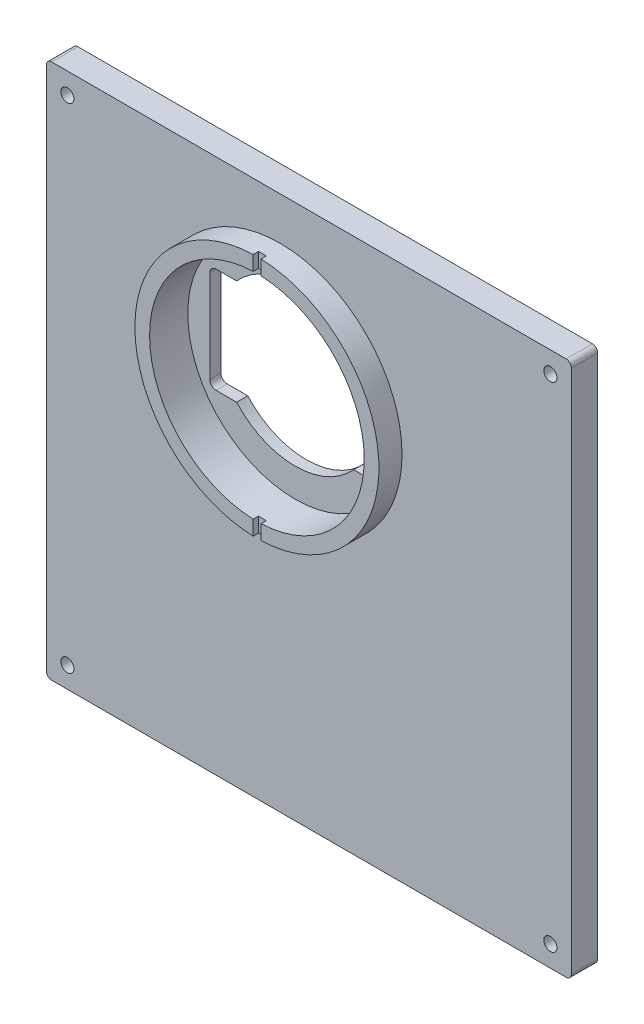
from build123d import *

# Parameters (mm, degrees)
BASE_EXTRUDE_DEPTH  = 6.35
BOSS_OD_R           = 29.5148
BOSS_EXTRUDE3_DEPTH = 5.588
SKETCH5_R           = 25.9588
CUT_EXTRUDE1_DEPTH  = 9.2456
SKETCH6_R           = 19.0119
CUT_EXTRUDE2_DEPTH  = 115.424169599
CUT_EXTRUDE3_DEPTH  = 115.424169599
SKETCH10_W          = 1.905
SKETCH10_H          = 69.451507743
CUT_EXTRUDE5_DEPTH  = 1.27
SKETCH15_R          = 1.5875
CUT_EXTRUDE7_DEPTH  = 115.226669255
SKETCH17_R          = 1.5875
CUT_EXTRUDE8_DEPTH  = 115.226669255


with BuildPart() as part:
    # Sketch1 → Base-Extrude (new body)
    with BuildSketch(Plane.XY):
        with BuildLine():
            Line((-56.515, 38.608), (-56.515, -88.392))
            ThreePointArc((-56.515, -88.392), (-56.143025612, -89.290025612), (-55.245, -89.662))
            Line((-55.245, -89.662), (69.215, -89.662))
            ThreePointArc((69.215, -89.662), (70.113025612, -89.290025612), (70.485, -88.392))
            Line((70.485, -88.392), (70.485, 38.608))
            ThreePointArc((70.485, 38.608), (70.113025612, 39.506025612), (69.215, 39.878))
            Line((69.215, 39.878), (-55.245, 39.878))
            ThreePointArc((-55.245, 39.878), (-56.143025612, 39.506025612), (-56.515, 38.608))
        make_face()
    extrude(amount=BASE_EXTRUDE_DEPTH)

    # BOSS OD → Boss-Extrude3 (add)
    with BuildSketch(Plane.XY.offset(6.35)):
        with Locations(Location((0, 0, 0), (0, 0, 268.273962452))):
            Circle(BOSS_OD_R)
    extrude(amount=BOSS_EXTRUDE3_DEPTH)

    # Sketch5 → Cut-Extrude1 (cut)
    with BuildSketch(Plane.XY.offset(11.938)):
        Circle(SKETCH5_R)
    extrude(amount=-CUT_EXTRUDE1_DEPTH, mode=Mode.SUBTRACT)

    # Sketch6 → Cut-Extrude2 (cut, through all)
    with BuildSketch(Plane.XY.offset(2.6924)):
        Circle(SKETCH6_R)
    extrude(amount=-CUT_EXTRUDE2_DEPTH, mode=Mode.SUBTRACT)

    # Sketch9 → Cut-Extrude3 (cut, through all)
    with BuildSketch(Plane.XY.offset(2.6924)):
        with BuildLine():
            Line((-19.1262, -12.7), (19.1008, -12.7))
            ThreePointArc((19.1008, -12.7), (20.178430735, -12.253630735), (20.6248, -11.176))
            Line((20.6248, -11.176), (20.6248, 11.176))
            ThreePointArc((20.6248, 11.176), (20.178430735, 12.253630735), (19.1008, 12.7))
            Line((19.1008, 12.7), (-19.1262, 12.7))
            ThreePointArc((-19.1262, 12.7), (-20.203830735, 12.253630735), (-20.6502, 11.176))
            Line((-20.6502, 11.176), (-20.6502, -11.176))
            ThreePointArc((-20.6502, -11.176), (-20.203830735, -12.253630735), (-19.1262, -12.7))
        make_face()
    extrude(amount=-CUT_EXTRUDE3_DEPTH, mode=Mode.SUBTRACT)

    # Sketch10 → Cut-Extrude5 (cut)
    with BuildSketch(Plane.XY.offset(11.938)):
        with Locations((0.0635, 0.611504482)):
            Rectangle(SKETCH10_W, SKETCH10_H)
    extrude(amount=-CUT_EXTRUDE5_DEPTH, mode=Mode.SUBTRACT)

    # Sketch15 → Cut-Extrude7 (cut, through all)
    with BuildSketch(Plane.XY.offset(6.35)):
        with Locations((65.405, -84.582)):
            Circle(SKETCH15_R)
    extrude(amount=-CUT_EXTRUDE7_DEPTH, mode=Mode.SUBTRACT)

    # Sketch17 → Cut-Extrude8 (cut, through all)
    with BuildSketch(Plane.XY.offset(6.35)):
        with Locations((-51.435, -84.582)):
            Circle(SKETCH17_R)
        with Locations((-51.435, 34.798)):
            Circle(SKETCH17_R)
        with Locations((65.405, 34.798)):
            Circle(SKETCH17_R)
    extrude(amount=-CUT_EXTRUDE8_DEPTH, mode=Mode.SUBTRACT)


solid = part.part
